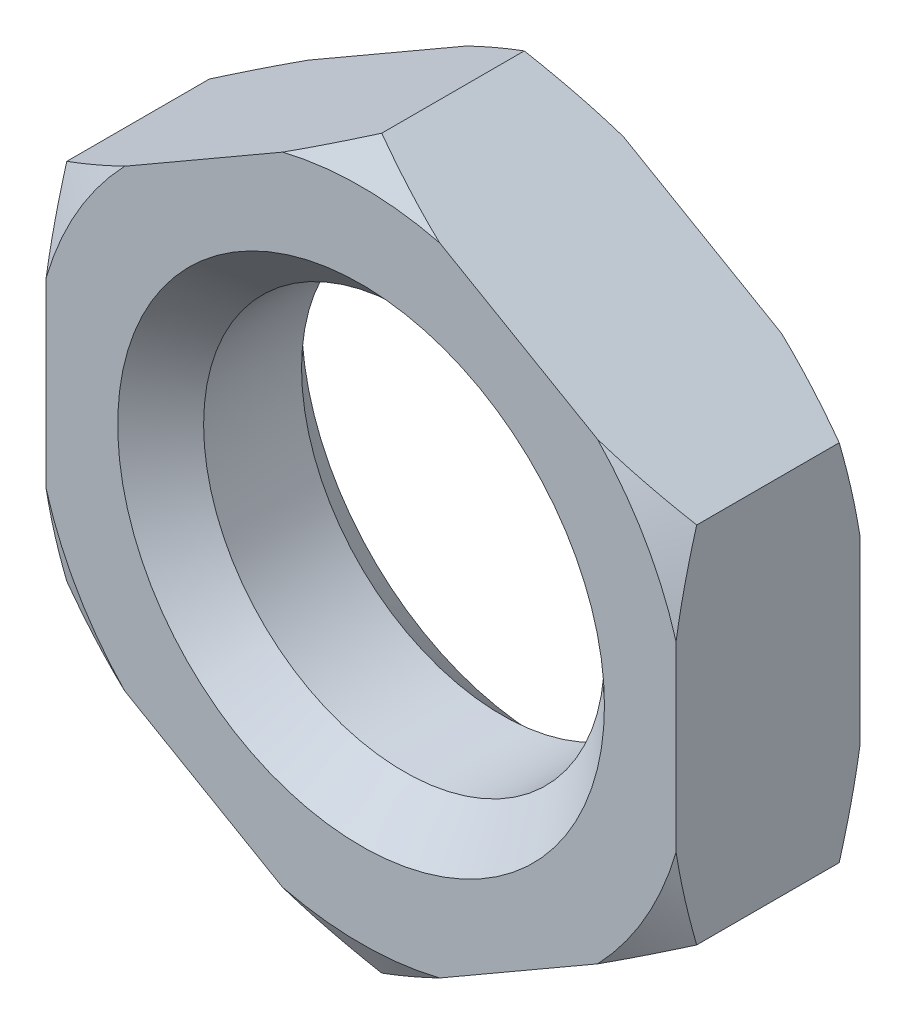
from build123d import *

# Parameters (mm, degrees)
SKETCH1_R           = 7
BOSS_EXTRUDE1_DEPTH = 3.21
CHAMFER1_SIZE       = 1.5


with BuildPart() as part:
    # Sketch1 → Boss-Extrude1 (new, symmetric)
    with BuildSketch(Plane.XY):
        Polygon((0, 12.701705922), (-11, 6.350852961), (-11, -6.350852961), (0, -12.701705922), (11, -6.350852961), (11, 6.350852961), align=None)
        with Locations(Location((0, 0, 0), (0, 0, 180))):
            Circle(SKETCH1_R, mode=Mode.SUBTRACT)
    extrude(amount=BOSS_EXTRUDE1_DEPTH, both=True)

    # Sketch3 → Cut-Revolve1 (revolve, cut)
    with BuildSketch(Plane(origin=(0, 0, 0), x_dir=(0, 0, -1), z_dir=(1, 0, 0))):
        Polygon((-3.21, 12.701705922), (-3.21, 11.451705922), (-2.488312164, 12.701705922), align=None)
    cut_revolve1 = revolve(axis=Axis((0, 0, -7.477018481), (0, 0, 1)), mode=Mode.SUBTRACT)

    # Mirror1: Cut-Revolve1 across plane
    add(cut_revolve1.mirror(Plane.XY), mode=Mode.SUBTRACT)

    # Chamfer1
    chamfer1_edges = [part.edges().sort_by_distance(p)[0] for p in [
        (7, 0, -3.21),
        (7, 0, 3.21),
    ]]
    chamfer(chamfer1_edges, length=CHAMFER1_SIZE)


solid = part.part
